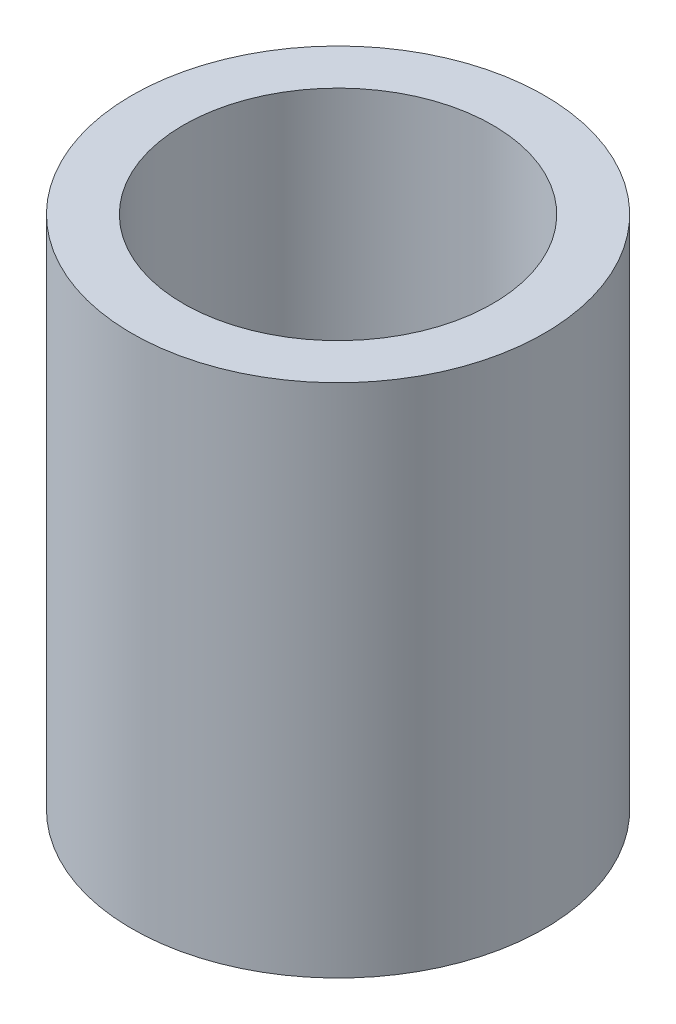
from build123d import *

# Parameters (mm, degrees)
ESQUISSE1_W = 5
ESQUISSE1_H = 50


with BuildPart() as part:
    # Esquisse1 → R_volution1 (revolve)
    with BuildSketch(Plane.XY, mode=Mode.PRIVATE) as r_volution1_sk:
        with Locations((17.5, 25)):
            Rectangle(ESQUISSE1_W, ESQUISSE1_H)
    revolve(r_volution1_sk.sketch.rotate(Axis((0, 83.539000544, 0), (0, -1, 0)), 180), axis=Axis((0, 83.539000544, 0), (0, -1, 0)))


solid = part.part
